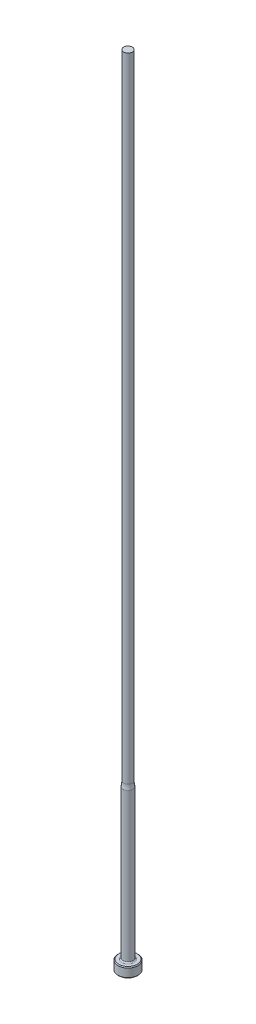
ISO-10303-21;
HEADER;
FILE_DESCRIPTION(('STEP AP214'),'2;1');
FILE_NAME('part.step','',(''),(''),'','','');
FILE_SCHEMA(('AUTOMOTIVE_DESIGN { 1 0 10303 214 1 1 1 1 }'));
ENDSEC;
DATA;
#1=APPLICATION_CONTEXT('core data for automotive mechanical design processes');
#2=APPLICATION_PROTOCOL_DEFINITION('international standard','automotive_design',2000,#1);
#3=PRODUCT_CONTEXT('',#1,'mechanical');
#4=PRODUCT('Part','Part','',(#3));
#5=PRODUCT_RELATED_PRODUCT_CATEGORY('part','',(#4));
#6=PRODUCT_DEFINITION_FORMATION('','',#4);
#7=PRODUCT_DEFINITION_CONTEXT('part definition',#1,'design');
#8=PRODUCT_DEFINITION('design','',#6,#7);
#9=PRODUCT_DEFINITION_SHAPE('','',#8);
#10=(LENGTH_UNIT() NAMED_UNIT(*) SI_UNIT(.MILLI.,.METRE.));
#11=(NAMED_UNIT(*) PLANE_ANGLE_UNIT() SI_UNIT($,.RADIAN.));
#12=(NAMED_UNIT(*) SI_UNIT($,.STERADIAN.) SOLID_ANGLE_UNIT());
#13=UNCERTAINTY_MEASURE_WITH_UNIT(LENGTH_MEASURE(1.E-05),#10,'distance_accuracy_value','');
#14=(GEOMETRIC_REPRESENTATION_CONTEXT(3) GLOBAL_UNCERTAINTY_ASSIGNED_CONTEXT((#13)) GLOBAL_UNIT_ASSIGNED_CONTEXT((#10,
#11,#12)) REPRESENTATION_CONTEXT('',''));
#15=CARTESIAN_POINT('',(0.,0.,0.));
#16=DIRECTION('',(0.,0.,1.));
#17=DIRECTION('',(1.,0.,0.));
#18=AXIS2_PLACEMENT_3D('',#15,#16,#17);
#19=CARTESIAN_POINT('',(-1.38810999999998,254.,0.));
#20=DIRECTION('',(0.,1.,0.));
#21=DIRECTION('',(0.,0.,1.));
#22=AXIS2_PLACEMENT_3D('',#19,#20,#21);
#23=PLANE('',#22);
#24=CARTESIAN_POINT('',(0.,254.,0.));
#25=DIRECTION('',(0.,1.,0.));
#26=DIRECTION('',(0.,0.,1.));
#27=AXIS2_PLACEMENT_3D('',#24,#25,#26);
#28=CIRCLE('',#27,1.38810999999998);
#29=CARTESIAN_POINT('',(0.,254.,1.38810999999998));
#30=VERTEX_POINT('',#29);
#31=EDGE_CURVE('E61',#30,#30,#28,.T.);
#32=ORIENTED_EDGE('',*,*,#31,.T.);
#33=EDGE_LOOP('',(#32));
#34=FACE_BOUND('',#33,.T.);
#35=ADVANCED_FACE('F35',(#34),#23,.T.);
#36=CARTESIAN_POINT('',(0.,259.958771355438,0.));
#37=DIRECTION('',(0.,1.,0.));
#38=DIRECTION('',(0.,0.,1.));
#39=AXIS2_PLACEMENT_3D('',#36,#37,#38);
#40=CYLINDRICAL_SURFACE('',#39,1.38810999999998);
#41=CARTESIAN_POINT('',(0.,52.3787642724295,0.));
#42=DIRECTION('',(0.,1.,0.));
#43=DIRECTION('',(0.,0.,1.));
#44=AXIS2_PLACEMENT_3D('',#41,#42,#43);
#45=CIRCLE('',#44,1.38810999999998);
#46=CARTESIAN_POINT('',(0.,52.3787642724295,1.38810999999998));
#47=VERTEX_POINT('',#46);
#48=EDGE_CURVE('E64',#47,#47,#45,.T.);
#49=ORIENTED_EDGE('',*,*,#48,.T.);
#50=EDGE_LOOP('',(#49));
#51=FACE_BOUND('',#50,.T.);
#52=ORIENTED_EDGE('',*,*,#31,.F.);
#53=EDGE_LOOP('',(#52));
#54=FACE_BOUND('',#53,.T.);
#55=ADVANCED_FACE('F84',(#51,#54),#40,.T.);
#56=CARTESIAN_POINT('',(0.,52.3787642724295,0.));
#57=DIRECTION('',(0.,1.,0.));
#58=DIRECTION('',(0.,0.,1.));
#59=AXIS2_PLACEMENT_3D('',#56,#57,#58);
#60=TOROIDAL_SURFACE('',#59,7.73810999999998,6.35);
#61=CARTESIAN_POINT('',(0.,50.8,0.));
#62=DIRECTION('',(0.,1.,0.));
#63=DIRECTION('',(0.,0.,1.));
#64=AXIS2_PLACEMENT_3D('',#61,#62,#63);
#65=CIRCLE('',#64,1.58749999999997);
#66=CARTESIAN_POINT('',(0.,50.8,1.58749999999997));
#67=VERTEX_POINT('',#66);
#68=EDGE_CURVE('E67',#67,#67,#65,.T.);
#69=ORIENTED_EDGE('',*,*,#68,.T.);
#70=EDGE_LOOP('',(#69));
#71=FACE_BOUND('',#70,.T.);
#72=ORIENTED_EDGE('',*,*,#48,.F.);
#73=EDGE_LOOP('',(#72));
#74=FACE_BOUND('',#73,.T.);
#75=ADVANCED_FACE('F71',(#71,#74),#60,.F.);
#76=CARTESIAN_POINT('',(0.,259.958771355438,0.));
#77=DIRECTION('',(0.,1.,0.));
#78=DIRECTION('',(0.,0.,1.));
#79=AXIS2_PLACEMENT_3D('',#76,#77,#78);
#80=CYLINDRICAL_SURFACE('',#79,1.58749999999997);
#81=CARTESIAN_POINT('',(0.,3.556,0.));
#82=DIRECTION('',(0.,1.,0.));
#83=DIRECTION('',(0.,0.,1.));
#84=AXIS2_PLACEMENT_3D('',#81,#82,#83);
#85=CIRCLE('',#84,1.58749999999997);
#86=CARTESIAN_POINT('',(0.,3.556,1.58749999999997));
#87=VERTEX_POINT('',#86);
#88=EDGE_CURVE('E42',#87,#87,#85,.T.);
#89=ORIENTED_EDGE('',*,*,#88,.T.);
#90=EDGE_LOOP('',(#89));
#91=FACE_BOUND('',#90,.T.);
#92=ORIENTED_EDGE('',*,*,#68,.F.);
#93=EDGE_LOOP('',(#92));
#94=FACE_BOUND('',#93,.T.);
#95=ADVANCED_FACE('F74',(#91,#94),#80,.T.);
#96=CARTESIAN_POINT('',(-3.17499999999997,3.175,0.));
#97=DIRECTION('',(0.,1.,0.));
#98=DIRECTION('',(0.,0.,1.));
#99=AXIS2_PLACEMENT_3D('',#96,#97,#98);
#100=PLANE('',#99);
#101=CARTESIAN_POINT('',(0.,3.175,0.));
#102=DIRECTION('',(0.,1.,0.));
#103=DIRECTION('',(0.,0.,1.));
#104=AXIS2_PLACEMENT_3D('',#101,#102,#103);
#105=CIRCLE('',#104,1.96849999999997);
#106=CARTESIAN_POINT('',(0.,3.175,1.96849999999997));
#107=VERTEX_POINT('',#106);
#108=EDGE_CURVE('E10',#107,#107,#105,.F.);
#109=ORIENTED_EDGE('',*,*,#108,.T.);
#110=EDGE_LOOP('',(#109));
#111=FACE_BOUND('',#110,.T.);
#112=CARTESIAN_POINT('',(0.,3.175,0.));
#113=DIRECTION('',(0.,1.,0.));
#114=DIRECTION('',(0.,0.,1.));
#115=AXIS2_PLACEMENT_3D('',#112,#113,#114);
#116=CIRCLE('',#115,2.92099999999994);
#117=CARTESIAN_POINT('',(0.,3.175,2.92099999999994));
#118=VERTEX_POINT('',#117);
#119=EDGE_CURVE('E58',#118,#118,#116,.T.);
#120=ORIENTED_EDGE('',*,*,#119,.T.);
#121=EDGE_LOOP('',(#120));
#122=FACE_BOUND('',#121,.T.);
#123=ADVANCED_FACE('F76',(#111,#122),#100,.T.);
#124=CARTESIAN_POINT('',(0.,259.958771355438,0.));
#125=DIRECTION('',(0.,1.,0.));
#126=DIRECTION('',(0.,0.,1.));
#127=AXIS2_PLACEMENT_3D('',#124,#125,#126);
#128=CYLINDRICAL_SURFACE('',#127,3.17499999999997);
#129=CARTESIAN_POINT('',(0.,2.92100000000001,0.));
#130=DIRECTION('',(0.,1.,0.));
#131=DIRECTION('',(0.,0.,1.));
#132=AXIS2_PLACEMENT_3D('',#129,#130,#131);
#133=CIRCLE('',#132,3.17499999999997);
#134=CARTESIAN_POINT('',(0.,2.92100000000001,3.17499999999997));
#135=VERTEX_POINT('',#134);
#136=EDGE_CURVE('E50',#135,#135,#133,.F.);
#137=ORIENTED_EDGE('',*,*,#136,.T.);
#138=EDGE_LOOP('',(#137));
#139=FACE_BOUND('',#138,.T.);
#140=CARTESIAN_POINT('',(0.,0.253999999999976,0.));
#141=DIRECTION('',(0.,-1.,0.));
#142=DIRECTION('',(0.,0.,-1.));
#143=AXIS2_PLACEMENT_3D('',#140,#141,#142);
#144=CIRCLE('',#143,3.17499999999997);
#145=CARTESIAN_POINT('',(0.,0.253999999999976,-3.17499999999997));
#146=VERTEX_POINT('',#145);
#147=EDGE_CURVE('E55',#146,#146,#144,.F.);
#148=ORIENTED_EDGE('',*,*,#147,.T.);
#149=EDGE_LOOP('',(#148));
#150=FACE_BOUND('',#149,.T.);
#151=ADVANCED_FACE('F82',(#139,#150),#128,.T.);
#152=CARTESIAN_POINT('',(0.,0.,0.));
#153=DIRECTION('',(0.,-1.,0.));
#154=DIRECTION('',(0.,0.,-1.));
#155=AXIS2_PLACEMENT_3D('',#152,#153,#154);
#156=PLANE('',#155);
#157=CARTESIAN_POINT('',(0.,0.,0.));
#158=DIRECTION('',(0.,-1.,0.));
#159=DIRECTION('',(0.,0.,-1.));
#160=AXIS2_PLACEMENT_3D('',#157,#158,#159);
#161=CIRCLE('',#160,2.92100000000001);
#162=CARTESIAN_POINT('',(0.,0.,-2.92100000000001));
#163=VERTEX_POINT('',#162);
#164=EDGE_CURVE('E46',#163,#163,#161,.T.);
#165=ORIENTED_EDGE('',*,*,#164,.T.);
#166=EDGE_LOOP('',(#165));
#167=FACE_BOUND('',#166,.T.);
#168=ADVANCED_FACE('F98',(#167),#156,.T.);
#169=CARTESIAN_POINT('',(0.,3.17499999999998,0.));
#170=DIRECTION('',(0.,-1.,0.));
#171=DIRECTION('',(0.,0.,-1.));
#172=AXIS2_PLACEMENT_3D('',#169,#170,#171);
#173=CONICAL_SURFACE('',#172,2.92099999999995,0.785398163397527);
#174=ORIENTED_EDGE('',*,*,#136,.F.);
#175=EDGE_LOOP('',(#174));
#176=FACE_BOUND('',#175,.T.);
#177=ORIENTED_EDGE('',*,*,#119,.F.);
#178=EDGE_LOOP('',(#177));
#179=FACE_BOUND('',#178,.T.);
#180=ADVANCED_FACE('F95',(#176,#179),#173,.T.);
#181=CARTESIAN_POINT('',(0.,0.253999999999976,0.));
#182=DIRECTION('',(0.,1.,0.));
#183=DIRECTION('',(0.,0.,1.));
#184=AXIS2_PLACEMENT_3D('',#181,#182,#183);
#185=CONICAL_SURFACE('',#184,3.17499999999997,0.785398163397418);
#186=ORIENTED_EDGE('',*,*,#164,.F.);
#187=EDGE_LOOP('',(#186));
#188=FACE_BOUND('',#187,.T.);
#189=ORIENTED_EDGE('',*,*,#147,.F.);
#190=EDGE_LOOP('',(#189));
#191=FACE_BOUND('',#190,.T.);
#192=ADVANCED_FACE('F97',(#188,#191),#185,.T.);
#193=CARTESIAN_POINT('',(0.,3.556,0.));
#194=DIRECTION('',(0.,1.,0.));
#195=DIRECTION('',(0.,0.,1.));
#196=AXIS2_PLACEMENT_3D('',#193,#194,#195);
#197=TOROIDAL_SURFACE('',#196,1.96849999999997,0.381);
#198=ORIENTED_EDGE('',*,*,#108,.F.);
#199=EDGE_LOOP('',(#198));
#200=FACE_BOUND('',#199,.T.);
#201=ORIENTED_EDGE('',*,*,#88,.F.);
#202=EDGE_LOOP('',(#201));
#203=FACE_BOUND('',#202,.T.);
#204=ADVANCED_FACE('F37',(#200,#203),#197,.F.);
#205=CLOSED_SHELL('',(#35,#55,#75,#95,#123,#151,#168,#180,#192,#204));
#206=MANIFOLD_SOLID_BREP('B2',#205);
#207=ADVANCED_BREP_SHAPE_REPRESENTATION('',(#18,#206),#14);
#208=SHAPE_DEFINITION_REPRESENTATION(#9,#207);
ENDSEC;
END-ISO-10303-21;
